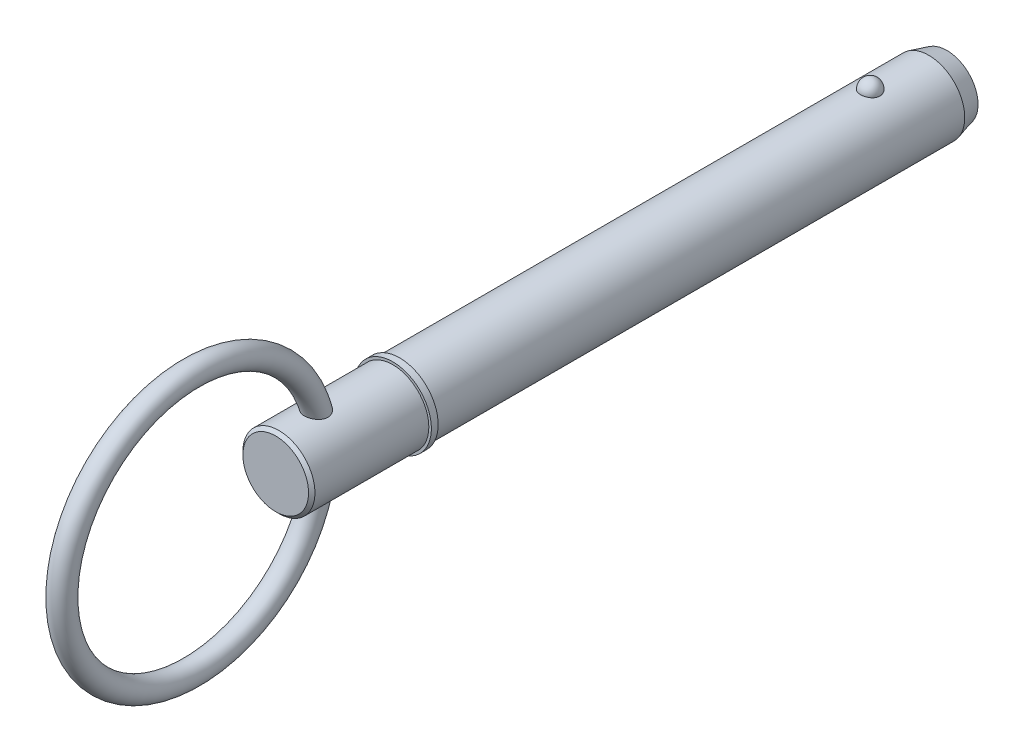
ISO-10303-21;
HEADER;
FILE_DESCRIPTION(('STEP AP214'),'2;1');
FILE_NAME('part.step','',(''),(''),'','','');
FILE_SCHEMA(('AUTOMOTIVE_DESIGN { 1 0 10303 214 1 1 1 1 }'));
ENDSEC;
DATA;
#1=APPLICATION_CONTEXT('core data for automotive mechanical design processes');
#2=APPLICATION_PROTOCOL_DEFINITION('international standard','automotive_design',2000,#1);
#3=PRODUCT_CONTEXT('',#1,'mechanical');
#4=PRODUCT('Part','Part','',(#3));
#5=PRODUCT_RELATED_PRODUCT_CATEGORY('part','',(#4));
#6=PRODUCT_DEFINITION_FORMATION('','',#4);
#7=PRODUCT_DEFINITION_CONTEXT('part definition',#1,'design');
#8=PRODUCT_DEFINITION('design','',#6,#7);
#9=PRODUCT_DEFINITION_SHAPE('','',#8);
#10=(LENGTH_UNIT() NAMED_UNIT(*) SI_UNIT(.MILLI.,.METRE.));
#11=(NAMED_UNIT(*) PLANE_ANGLE_UNIT() SI_UNIT($,.RADIAN.));
#12=(NAMED_UNIT(*) SI_UNIT($,.STERADIAN.) SOLID_ANGLE_UNIT());
#13=UNCERTAINTY_MEASURE_WITH_UNIT(LENGTH_MEASURE(1.E-05),#10,'distance_accuracy_value','');
#14=(GEOMETRIC_REPRESENTATION_CONTEXT(3) GLOBAL_UNCERTAINTY_ASSIGNED_CONTEXT((#13)) GLOBAL_UNIT_ASSIGNED_CONTEXT((#10,
#11,#12)) REPRESENTATION_CONTEXT('',''));
#15=CARTESIAN_POINT('',(0.,0.,0.));
#16=DIRECTION('',(0.,0.,1.));
#17=DIRECTION('',(1.,0.,0.));
#18=AXIS2_PLACEMENT_3D('',#15,#16,#17);
#19=CARTESIAN_POINT('',(0.,0.,101.6));
#20=DIRECTION('',(0.,0.,-1.));
#21=DIRECTION('',(-1.,0.,0.));
#22=AXIS2_PLACEMENT_3D('',#19,#20,#21);
#23=CYLINDRICAL_SURFACE('',#22,7.94);
#24=CARTESIAN_POINT('',(2.13020349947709,7.64891057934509,-2.15));
#25=CARTESIAN_POINT('',(2.1302012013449,7.64891247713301,-2.02978166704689));
#26=CARTESIAN_POINT('',(2.12037546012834,7.65166842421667,-1.90953383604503));
#27=CARTESIAN_POINT('',(2.08130792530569,7.66238579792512,-1.67243962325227));
#28=CARTESIAN_POINT('',(2.05205785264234,7.67034944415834,-1.55559471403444));
#29=CARTESIAN_POINT('',(1.97489181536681,7.69057749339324,-1.32869361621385));
#30=CARTESIAN_POINT('',(1.92698409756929,7.70283999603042,-1.21863445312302));
#31=CARTESIAN_POINT('',(1.81370645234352,7.73029430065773,-1.00831338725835));
#32=CARTESIAN_POINT('',(1.74833715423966,7.7454859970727,-0.908051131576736));
#33=CARTESIAN_POINT('',(1.60144242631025,7.77718699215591,-0.719628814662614));
#34=CARTESIAN_POINT('',(1.51984382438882,7.7937020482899,-0.631526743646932));
#35=CARTESIAN_POINT('',(1.34279837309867,7.82614685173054,-0.470411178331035));
#36=CARTESIAN_POINT('',(1.24735148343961,7.84207659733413,-0.397397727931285));
#37=CARTESIAN_POINT('',(1.04544839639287,7.87153116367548,-0.26868118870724));
#38=CARTESIAN_POINT('',(0.939022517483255,7.88506234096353,-0.212932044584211));
#39=CARTESIAN_POINT('',(0.717931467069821,7.90825597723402,-0.120080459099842));
#40=CARTESIAN_POINT('',(0.603267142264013,7.9179188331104,-0.0829761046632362));
#41=CARTESIAN_POINT('',(0.371015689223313,7.93216561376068,-0.0289596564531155));
#42=CARTESIAN_POINT('',(0.253510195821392,7.93683225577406,-0.0117183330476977));
#43=CARTESIAN_POINT('',(0.0171784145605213,7.94086051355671,0.0031892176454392));
#44=CARTESIAN_POINT('',(-0.101647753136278,7.94022260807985,0.00085721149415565));
#45=CARTESIAN_POINT('',(-0.335567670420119,7.93375751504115,-0.023146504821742));
#46=CARTESIAN_POINT('',(-0.450690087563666,7.92799987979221,-0.0445590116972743));
#47=CARTESIAN_POINT('',(-0.675610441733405,7.91200792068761,-0.105760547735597));
#48=CARTESIAN_POINT('',(-0.785408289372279,7.90177352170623,-0.145549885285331));
#49=CARTESIAN_POINT('',(-0.9972706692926,7.87784802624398,-0.242675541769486));
#50=CARTESIAN_POINT('',(-1.0992893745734,7.86413823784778,-0.300107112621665));
#51=CARTESIAN_POINT('',(-1.29223659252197,7.83474718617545,-0.430887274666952));
#52=CARTESIAN_POINT('',(-1.38316404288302,7.81906573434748,-0.504237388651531));
#53=CARTESIAN_POINT('',(-1.55313516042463,7.78710451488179,-0.666358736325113));
#54=CARTESIAN_POINT('',(-1.63193689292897,7.77081906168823,-0.75538257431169));
#55=CARTESIAN_POINT('',(-1.77366356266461,7.73970270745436,-0.945507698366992));
#56=CARTESIAN_POINT('',(-1.83658745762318,7.72487190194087,-1.04660977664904));
#57=CARTESIAN_POINT('',(-1.94556640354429,7.6981535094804,-1.25927689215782));
#58=CARTESIAN_POINT('',(-1.99143480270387,7.6862989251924,-1.3709418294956));
#59=CARTESIAN_POINT('',(-2.06418311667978,7.66708387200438,-1.60066153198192));
#60=CARTESIAN_POINT('',(-2.0910635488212,7.65972328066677,-1.71871612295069));
#61=CARTESIAN_POINT('',(-2.12508507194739,7.65035479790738,-1.9573607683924));
#62=CARTESIAN_POINT('',(-2.13230490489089,7.64832555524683,-2.0779387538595));
#63=CARTESIAN_POINT('',(-2.12704767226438,7.64978921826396,-2.31862835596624));
#64=CARTESIAN_POINT('',(-2.1145710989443,7.6532819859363,-2.43873998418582));
#65=CARTESIAN_POINT('',(-2.07034166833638,7.66536368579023,-2.67451689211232));
#66=CARTESIAN_POINT('',(-2.03867758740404,7.67392914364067,-2.79020005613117));
#67=CARTESIAN_POINT('',(-1.95694065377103,7.69517736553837,-3.01446692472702));
#68=CARTESIAN_POINT('',(-1.90686710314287,7.70786028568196,-3.12305035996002));
#69=CARTESIAN_POINT('',(-1.78925555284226,7.73600831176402,-3.3306597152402));
#70=CARTESIAN_POINT('',(-1.72162904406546,7.75148739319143,-3.4296336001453));
#71=CARTESIAN_POINT('',(-1.57074739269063,7.78346215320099,-3.61466914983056));
#72=CARTESIAN_POINT('',(-1.48749169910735,7.79995786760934,-3.70073035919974));
#73=CARTESIAN_POINT('',(-1.30720250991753,7.83219119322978,-3.85783594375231));
#74=CARTESIAN_POINT('',(-1.2101234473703,7.84792605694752,-3.92882863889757));
#75=CARTESIAN_POINT('',(-1.00503150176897,7.87681523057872,-4.05342383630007));
#76=CARTESIAN_POINT('',(-0.897019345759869,7.88996971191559,-4.10702749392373));
#77=CARTESIAN_POINT('',(-0.674439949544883,7.91208451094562,-4.19477736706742));
#78=CARTESIAN_POINT('',(-0.55996501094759,7.92109245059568,-4.22914554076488));
#79=CARTESIAN_POINT('',(-0.326625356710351,7.93413878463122,-4.27838865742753));
#80=CARTESIAN_POINT('',(-0.20776113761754,7.93817773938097,-4.29326579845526));
#81=CARTESIAN_POINT('',(0.0287357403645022,7.94081322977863,-4.3030062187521));
#82=CARTESIAN_POINT('',(0.14635312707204,7.93950453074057,-4.29821797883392));
#83=CARTESIAN_POINT('',(0.379062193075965,7.93180098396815,-4.26955229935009));
#84=CARTESIAN_POINT('',(0.494153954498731,7.92540630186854,-4.24567548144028));
#85=CARTESIAN_POINT('',(0.718185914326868,7.90824874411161,-4.17962260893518));
#86=CARTESIAN_POINT('',(0.827145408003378,7.89750055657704,-4.13750805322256));
#87=CARTESIAN_POINT('',(1.03638036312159,7.87277755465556,-4.03615078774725));
#88=CARTESIAN_POINT('',(1.13665531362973,7.85880255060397,-3.97690707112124));
#89=CARTESIAN_POINT('',(1.32729731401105,7.82887859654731,-3.84189297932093));
#90=CARTESIAN_POINT('',(1.41749828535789,7.81290379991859,-3.76589388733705));
#91=CARTESIAN_POINT('',(1.58397257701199,7.78086330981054,-3.59992466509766));
#92=CARTESIAN_POINT('',(1.66024342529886,7.76479760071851,-3.50995206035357));
#93=CARTESIAN_POINT('',(1.79805631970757,7.73405928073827,-3.31688321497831));
#94=CARTESIAN_POINT('',(1.85933944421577,7.719413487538,-3.213597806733));
#95=CARTESIAN_POINT('',(1.96397499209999,7.69345992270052,-2.99796163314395));
#96=CARTESIAN_POINT('',(2.00733488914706,7.68215076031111,-2.88561466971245));
#97=CARTESIAN_POINT('',(2.07068045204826,7.66529896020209,-2.6699413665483));
#98=CARTESIAN_POINT('',(2.09296296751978,7.65919990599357,-2.56732606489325));
#99=CARTESIAN_POINT('',(2.12272535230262,7.65100492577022,-2.35981463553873));
#100=CARTESIAN_POINT('',(2.13020550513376,7.64890892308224,-2.25491855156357));
#101=CARTESIAN_POINT('',(2.13020349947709,7.64891057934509,-2.15));
#102=B_SPLINE_CURVE_WITH_KNOTS('',3,(#24,#25,#26,#27,#28,#29,#30,#31,#32,#33,#34,#35,#36,#37,
#38,#39,#40,#41,#42,#43,#44,#45,#46,#47,#48,#49,#50,#51,#52,#53,#54,#55,#56,#57,#58,#59,#60,#61,
#62,#63,#64,#65,#66,#67,#68,#69,#70,#71,#72,#73,#74,#75,#76,#77,#78,#79,#80,#81,#82,#83,#84,#85,
#86,#87,#88,#89,#90,#91,#92,#93,#94,#95,#96,#97,#98,#99,#100,#101),.UNSPECIFIED.,.T.,.F.,(4,2,2,
2,2,2,2,2,2,2,2,2,2,2,2,2,2,2,2,2,2,2,2,2,2,2,2,2,2,2,2,2,2,2,2,2,2,2,4),(0.,0.360277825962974,
0.720709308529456,1.0809816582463,1.44124102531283,1.80316307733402,2.16508618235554,
2.52603531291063,2.88694740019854,3.24178717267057,3.59659491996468,3.94665496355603,
4.29672088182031,4.64871108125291,5.0007349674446,5.3590619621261,5.71741247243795,
6.079576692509,6.44173104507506,6.80243279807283,7.16312553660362,7.52216203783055,
7.88121215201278,8.24210915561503,8.60301888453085,8.96514709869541,9.32725124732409,
9.68508606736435,10.0428805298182,10.3943622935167,10.7458326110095,11.0961268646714,
11.4464417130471,11.8018724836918,12.1573662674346,12.5186252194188,12.8797333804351,
13.1941658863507,13.5085923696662),.UNSPECIFIED.);
#103=CARTESIAN_POINT('',(2.13020349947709,7.64891057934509,-2.15));
#104=VERTEX_POINT('',#103);
#105=EDGE_CURVE('E102',#104,#104,#102,.T.);
#106=ORIENTED_EDGE('',*,*,#105,.T.);
#107=EDGE_LOOP('',(#106));
#108=FACE_BOUND('',#107,.T.);
#109=CARTESIAN_POINT('',(0.,0.,-15.05));
#110=DIRECTION('',(0.,0.,-1.));
#111=DIRECTION('',(-1.,0.,0.));
#112=AXIS2_PLACEMENT_3D('',#109,#110,#111);
#113=CIRCLE('',#112,7.94);
#114=CARTESIAN_POINT('',(-7.94,0.,-15.05));
#115=VERTEX_POINT('',#114);
#116=EDGE_CURVE('E110',#115,#115,#113,.F.);
#117=ORIENTED_EDGE('',*,*,#116,.T.);
#118=EDGE_LOOP('',(#117));
#119=FACE_BOUND('',#118,.T.);
#120=CARTESIAN_POINT('',(0.,0.,101.6));
#121=DIRECTION('',(0.,0.,1.));
#122=DIRECTION('',(1.,0.,0.));
#123=AXIS2_PLACEMENT_3D('',#120,#121,#122);
#124=CIRCLE('',#123,7.94);
#125=CARTESIAN_POINT('',(7.94,0.,101.6));
#126=VERTEX_POINT('',#125);
#127=EDGE_CURVE('E108',#126,#126,#124,.T.);
#128=ORIENTED_EDGE('',*,*,#127,.F.);
#129=EDGE_LOOP('',(#128));
#130=FACE_BOUND('',#129,.T.);
#131=ADVANCED_FACE('F39',(#108,#119,#130),#23,.T.);
#132=CARTESIAN_POINT('',(0.,0.,-19.05));
#133=DIRECTION('',(0.,0.,-1.));
#134=DIRECTION('',(-1.,0.,0.));
#135=AXIS2_PLACEMENT_3D('',#132,#133,#134);
#136=PLANE('',#135);
#137=CARTESIAN_POINT('',(0.,0.,-19.05));
#138=DIRECTION('',(0.,0.,-1.));
#139=DIRECTION('',(-1.,0.,0.));
#140=AXIS2_PLACEMENT_3D('',#137,#138,#139);
#141=CIRCLE('',#140,6.8682032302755);
#142=CARTESIAN_POINT('',(-6.8682032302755,0.,-19.05));
#143=VERTEX_POINT('',#142);
#144=EDGE_CURVE('E144',#143,#143,#141,.T.);
#145=ORIENTED_EDGE('',*,*,#144,.T.);
#146=EDGE_LOOP('',(#145));
#147=FACE_BOUND('',#146,.T.);
#148=ADVANCED_FACE('F88',(#147),#136,.T.);
#149=CARTESIAN_POINT('',(0.,0.,-19.05));
#150=DIRECTION('',(0.,0.,1.));
#151=DIRECTION('',(1.,0.,0.));
#152=AXIS2_PLACEMENT_3D('',#149,#150,#151);
#153=CONICAL_SURFACE('',#152,6.8682032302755,0.261799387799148);
#154=ORIENTED_EDGE('',*,*,#116,.F.);
#155=EDGE_LOOP('',(#154));
#156=FACE_BOUND('',#155,.T.);
#157=ORIENTED_EDGE('',*,*,#144,.F.);
#158=EDGE_LOOP('',(#157));
#159=FACE_BOUND('',#158,.T.);
#160=ADVANCED_FACE('F94',(#156,#159),#153,.T.);
#161=CARTESIAN_POINT('',(0.,7.94,-2.15));
#162=DIRECTION('',(0.,1.,0.));
#163=DIRECTION('',(0.,0.,-1.));
#164=AXIS2_PLACEMENT_3D('',#161,#162,#163);
#165=SPHERICAL_SURFACE('',#164,2.15);
#166=ORIENTED_EDGE('',*,*,#105,.F.);
#167=EDGE_LOOP('',(#166));
#168=FACE_BOUND('',#167,.T.);
#169=ADVANCED_FACE('F113',(#168),#165,.T.);
#170=CARTESIAN_POINT('',(0.,0.,101.6));
#171=DIRECTION('',(0.,0.,-1.));
#172=DIRECTION('',(-1.,0.,0.));
#173=AXIS2_PLACEMENT_3D('',#170,#171,#172);
#174=PLANE('',#173);
#175=ORIENTED_EDGE('',*,*,#127,.T.);
#176=EDGE_LOOP('',(#175));
#177=FACE_BOUND('',#176,.T.);
#178=CARTESIAN_POINT('',(0.,0.,101.6));
#179=DIRECTION('',(0.,0.,-1.));
#180=DIRECTION('',(-1.,0.,0.));
#181=AXIS2_PLACEMENT_3D('',#178,#179,#180);
#182=CIRCLE('',#181,8.5);
#183=CARTESIAN_POINT('',(-8.5,0.,101.6));
#184=VERTEX_POINT('',#183);
#185=EDGE_CURVE('E109',#184,#184,#182,.T.);
#186=ORIENTED_EDGE('',*,*,#185,.T.);
#187=EDGE_LOOP('',(#186));
#188=FACE_BOUND('',#187,.T.);
#189=ADVANCED_FACE('F117',(#177,#188),#174,.T.);
#190=CARTESIAN_POINT('',(0.,0.,33.7287874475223));
#191=DIRECTION('',(0.,0.,-1.));
#192=DIRECTION('',(-1.,0.,0.));
#193=AXIS2_PLACEMENT_3D('',#190,#191,#192);
#194=CYLINDRICAL_SURFACE('',#193,8.5);
#195=CARTESIAN_POINT('',(0.,0.,103.1));
#196=DIRECTION('',(0.,0.,-1.));
#197=DIRECTION('',(-1.,0.,0.));
#198=AXIS2_PLACEMENT_3D('',#195,#196,#197);
#199=CIRCLE('',#198,8.5);
#200=CARTESIAN_POINT('',(-8.5,0.,103.1));
#201=VERTEX_POINT('',#200);
#202=EDGE_CURVE('E134',#201,#201,#199,.T.);
#203=ORIENTED_EDGE('',*,*,#202,.T.);
#204=EDGE_LOOP('',(#203));
#205=FACE_BOUND('',#204,.T.);
#206=ORIENTED_EDGE('',*,*,#185,.F.);
#207=EDGE_LOOP('',(#206));
#208=FACE_BOUND('',#207,.T.);
#209=ADVANCED_FACE('F121',(#205,#208),#194,.T.);
#210=CARTESIAN_POINT('',(0.,8.5,103.1));
#211=DIRECTION('',(0.,0.,1.));
#212=DIRECTION('',(1.,0.,0.));
#213=AXIS2_PLACEMENT_3D('',#210,#211,#212);
#214=PLANE('',#213);
#215=CARTESIAN_POINT('',(0.,0.,103.1));
#216=DIRECTION('',(0.,0.,1.));
#217=DIRECTION('',(1.,0.,0.));
#218=AXIS2_PLACEMENT_3D('',#215,#216,#217);
#219=CIRCLE('',#218,7.94);
#220=CARTESIAN_POINT('',(7.94,0.,103.1));
#221=VERTEX_POINT('',#220);
#222=EDGE_CURVE('E112',#221,#221,#219,.T.);
#223=ORIENTED_EDGE('',*,*,#222,.F.);
#224=EDGE_LOOP('',(#223));
#225=FACE_BOUND('',#224,.T.);
#226=ORIENTED_EDGE('',*,*,#202,.F.);
#227=EDGE_LOOP('',(#226));
#228=FACE_BOUND('',#227,.T.);
#229=ADVANCED_FACE('F85',(#225,#228),#214,.T.);
#230=CARTESIAN_POINT('',(0.,0.,128.91));
#231=DIRECTION('',(0.,0.,-1.));
#232=DIRECTION('',(-1.,0.,0.));
#233=AXIS2_PLACEMENT_3D('',#230,#231,#232);
#234=CYLINDRICAL_SURFACE('',#233,7.94);
#235=CARTESIAN_POINT('',(-1.15544091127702,-7.85547938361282,117.711910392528));
#236=CARTESIAN_POINT('',(-1.03089695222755,-7.87379554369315,117.649615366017));
#237=CARTESIAN_POINT('',(-0.900845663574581,-7.8898743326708,117.597593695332));
#238=CARTESIAN_POINT('',(-0.633417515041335,-7.91583465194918,117.515265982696));
#239=CARTESIAN_POINT('',(-0.496037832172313,-7.92571377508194,117.484968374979));
#240=CARTESIAN_POINT('',(-0.217881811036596,-7.93823020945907,117.446773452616));
#241=CARTESIAN_POINT('',(-0.0771057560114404,-7.94086812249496,117.438874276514));
#242=CARTESIAN_POINT('',(0.20382834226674,-7.93862624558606,117.445648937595));
#243=CARTESIAN_POINT('',(0.343986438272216,-7.93374711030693,117.460320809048));
#244=CARTESIAN_POINT('',(0.61954486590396,-7.9169944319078,117.511877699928));
#245=CARTESIAN_POINT('',(0.754950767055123,-7.9051293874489,117.548735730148));
#246=CARTESIAN_POINT('',(1.01737529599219,-7.8756583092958,117.643842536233));
#247=CARTESIAN_POINT('',(1.14439334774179,-7.85805188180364,117.702092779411));
#248=CARTESIAN_POINT('',(1.38668443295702,-7.81893907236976,117.838842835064));
#249=CARTESIAN_POINT('',(1.50193494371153,-7.79742542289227,117.917380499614));
#250=CARTESIAN_POINT('',(1.71711272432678,-7.75288428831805,118.092872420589));
#251=CARTESIAN_POINT('',(1.81704089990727,-7.72985689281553,118.189825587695));
#252=CARTESIAN_POINT('',(1.99787261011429,-7.68509802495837,118.39887149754));
#253=CARTESIAN_POINT('',(2.07893183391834,-7.66335713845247,118.510827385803));
#254=CARTESIAN_POINT('',(2.2207658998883,-7.6234672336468,118.747480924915));
#255=CARTESIAN_POINT('',(2.28154607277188,-7.6053172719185,118.872175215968));
#256=CARTESIAN_POINT('',(2.38011540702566,-7.57504217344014,119.127618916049));
#257=CARTESIAN_POINT('',(2.41840843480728,-7.56278621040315,119.258158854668));
#258=CARTESIAN_POINT('',(2.47363993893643,-7.54490265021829,119.524095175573));
#259=CARTESIAN_POINT('',(2.49057788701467,-7.53927521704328,119.659491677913));
#260=CARTESIAN_POINT('',(2.50351014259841,-7.53499042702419,119.93242871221));
#261=CARTESIAN_POINT('',(2.49933630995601,-7.53638902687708,120.069977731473));
#262=CARTESIAN_POINT('',(2.47072547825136,-7.54581524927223,120.342698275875));
#263=CARTESIAN_POINT('',(2.44628184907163,-7.55384504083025,120.477869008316));
#264=CARTESIAN_POINT('',(2.3758931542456,-7.57629160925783,120.753085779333));
#265=CARTESIAN_POINT('',(2.32844094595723,-7.5911515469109,120.89270896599));
#266=CARTESIAN_POINT('',(2.21332780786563,-7.62550828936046,121.162781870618));
#267=CARTESIAN_POINT('',(2.14565489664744,-7.64500784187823,121.293226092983));
#268=CARTESIAN_POINT('',(1.98438755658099,-7.68852412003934,121.553702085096));
#269=CARTESIAN_POINT('',(1.88896913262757,-7.71279219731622,121.682569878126));
#270=CARTESIAN_POINT('',(1.67743245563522,-7.76154719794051,121.922112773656));
#271=CARTESIAN_POINT('',(1.56130644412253,-7.78603420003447,122.032781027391));
#272=CARTESIAN_POINT('',(1.31168281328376,-7.83191501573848,122.230100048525));
#273=CARTESIAN_POINT('',(1.17841631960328,-7.85334315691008,122.317029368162));
#274=CARTESIAN_POINT('',(0.967442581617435,-7.88116219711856,122.426657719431));
#275=CARTESIAN_POINT('',(0.895283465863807,-7.88971376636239,122.459736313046));
#276=CARTESIAN_POINT('',(0.747777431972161,-7.90505596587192,122.518400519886));
#277=CARTESIAN_POINT('',(0.672431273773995,-7.91184701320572,122.543987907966));
#278=CARTESIAN_POINT('',(0.53057561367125,-7.92252382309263,122.583912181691));
#279=CARTESIAN_POINT('',(0.464394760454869,-7.92668987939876,122.599349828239));
#280=CARTESIAN_POINT('',(0.330815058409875,-7.9333870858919,122.624069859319));
#281=CARTESIAN_POINT('',(0.263416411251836,-7.93591850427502,122.63335325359));
#282=CARTESIAN_POINT('',(0.128041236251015,-7.93925585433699,122.645577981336));
#283=CARTESIAN_POINT('',(0.0600650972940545,-7.94006286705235,122.648523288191));
#284=CARTESIAN_POINT('',(-0.0758408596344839,-7.93992929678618,122.648033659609));
#285=CARTESIAN_POINT('',(-0.143770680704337,-7.93898884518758,122.644599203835));
#286=CARTESIAN_POINT('',(-0.330023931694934,-7.93402174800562,122.626406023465));
#287=CARTESIAN_POINT('',(-0.447720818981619,-7.92820264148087,122.605060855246));
#288=CARTESIAN_POINT('',(-0.677833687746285,-7.91185818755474,122.544093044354));
#289=CARTESIAN_POINT('',(-0.790248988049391,-7.90133223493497,122.504468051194));
#290=CARTESIAN_POINT('',(-1.01082100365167,-7.8762011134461,122.407436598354));
#291=CARTESIAN_POINT('',(-1.11873674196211,-7.86147932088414,122.349515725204));
#292=CARTESIAN_POINT('',(-1.32464461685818,-7.8294189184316,122.218755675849));
#293=CARTESIAN_POINT('',(-1.42263264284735,-7.81207923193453,122.145910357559));
#294=CARTESIAN_POINT('',(-1.62038324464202,-7.77363945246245,121.976536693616));
#295=CARTESIAN_POINT('',(-1.7184938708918,-7.75235190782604,121.878123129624));
#296=CARTESIAN_POINT('',(-1.89908721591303,-7.71010284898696,121.667783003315));
#297=CARTESIAN_POINT('',(-1.9815587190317,-7.68914157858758,121.555846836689));
#298=CARTESIAN_POINT('',(-2.1397427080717,-7.64674394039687,121.305108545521));
#299=CARTESIAN_POINT('',(-2.21304020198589,-7.62562536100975,121.164719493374));
#300=CARTESIAN_POINT('',(-2.33615659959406,-7.5888154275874,120.873266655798));
#301=CARTESIAN_POINT('',(-2.38596943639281,-7.57312547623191,120.722200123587));
#302=CARTESIAN_POINT('',(-2.46059473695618,-7.54921618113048,120.410492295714));
#303=CARTESIAN_POINT('',(-2.48494918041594,-7.54113395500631,120.249728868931));
#304=CARTESIAN_POINT('',(-2.50480773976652,-7.53456588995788,119.926244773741));
#305=CARTESIAN_POINT('',(-2.50033692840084,-7.53607171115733,119.763525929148));
#306=CARTESIAN_POINT('',(-2.46306926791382,-7.54832452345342,119.457165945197));
#307=CARTESIAN_POINT('',(-2.4329569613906,-7.55819528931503,119.313162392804));
#308=CARTESIAN_POINT('',(-2.34806892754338,-7.58499431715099,119.033304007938));
#309=CARTESIAN_POINT('',(-2.29330013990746,-7.60192059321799,118.897446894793));
#310=CARTESIAN_POINT('',(-2.16523724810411,-7.63933506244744,118.64765733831));
#311=CARTESIAN_POINT('',(-2.09353456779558,-7.65948502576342,118.532853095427));
#312=CARTESIAN_POINT('',(-1.93200913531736,-7.7018104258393,118.317268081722));
#313=CARTESIAN_POINT('',(-1.84219262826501,-7.72398516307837,118.216482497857));
#314=CARTESIAN_POINT('',(-1.65746337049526,-7.76558957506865,118.04131484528));
#315=CARTESIAN_POINT('',(-1.56413624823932,-7.78505810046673,117.965259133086));
#316=CARTESIAN_POINT('',(-1.36706423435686,-7.82207051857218,117.82753576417));
#317=CARTESIAN_POINT('',(-1.26331856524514,-7.83961426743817,117.765869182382));
#318=CARTESIAN_POINT('',(-1.15544091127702,-7.85547938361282,117.711910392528));
#319=B_SPLINE_CURVE_WITH_KNOTS('',3,(#235,#236,#237,#238,#239,#240,#241,#242,#243,#244,#245,
#246,#247,#248,#249,#250,#251,#252,#253,#254,#255,#256,#257,#258,#259,#260,#261,#262,#263,#264,
#265,#266,#267,#268,#269,#270,#271,#272,#273,#274,#275,#276,#277,#278,#279,#280,#281,#282,#283,
#284,#285,#286,#287,#288,#289,#290,#291,#292,#293,#294,#295,#296,#297,#298,#299,#300,#301,#302,
#303,#304,#305,#306,#307,#308,#309,#310,#311,#312,#313,#314,#315,#316,#317,#318),.UNSPECIFIED.,
.T.,.F.,(4,2,2,2,2,2,2,2,2,2,2,2,2,2,2,2,2,2,2,2,2,2,2,2,2,2,2,2,2,2,2,2,2,2,2,2,2,2,2,2,2,4),
(0.,0.420927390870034,0.842018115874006,1.26307384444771,1.68409290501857,2.10460083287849,
2.52513760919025,2.94646475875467,3.36776699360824,3.78545897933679,4.20304108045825,
4.61086922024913,5.01870744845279,5.42979890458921,5.84102487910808,6.2838331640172,
6.72690434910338,7.21113455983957,7.69554657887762,8.17400305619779,8.41316278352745,
8.65226580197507,8.85622998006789,9.0601606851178,9.26396350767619,9.46775100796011,
9.82521046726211,10.1827159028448,10.5513335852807,10.9201032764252,11.3402098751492,
11.7606166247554,12.2377707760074,12.715048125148,13.2007716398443,13.6860727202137,
14.1260485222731,14.5659005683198,14.9745225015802,15.3830037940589,15.7475760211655,
16.1121754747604),.UNSPECIFIED.);
#320=CARTESIAN_POINT('',(-1.15544091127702,-7.85547938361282,117.711910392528));
#321=VERTEX_POINT('',#320);
#322=EDGE_CURVE('E10',#321,#321,#319,.T.);
#323=ORIENTED_EDGE('',*,*,#322,.F.);
#324=EDGE_LOOP('',(#323));
#325=FACE_BOUND('',#324,.T.);
#326=CARTESIAN_POINT('',(-1.15544091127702,7.85547938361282,117.711910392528));
#327=CARTESIAN_POINT('',(-1.278579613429,7.83736699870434,117.773507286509));
#328=CARTESIAN_POINT('',(-1.39638360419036,7.8170599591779,117.845172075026));
#329=CARTESIAN_POINT('',(-1.61803025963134,7.77421032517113,118.00708252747));
#330=CARTESIAN_POINT('',(-1.72186951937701,7.7516671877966,118.097332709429));
#331=CARTESIAN_POINT('',(-1.91269683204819,7.70680387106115,118.294395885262));
#332=CARTESIAN_POINT('',(-1.99967065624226,7.68448389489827,118.401222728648));
#333=CARTESIAN_POINT('',(-2.15412555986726,7.64262858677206,118.628607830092));
#334=CARTESIAN_POINT('',(-2.2216118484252,7.62309251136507,118.749162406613));
#335=CARTESIAN_POINT('',(-2.3342927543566,7.5893410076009,118.998377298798));
#336=CARTESIAN_POINT('',(-2.3798562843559,7.57503857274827,119.126859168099));
#337=CARTESIAN_POINT('',(-2.44955571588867,7.55278941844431,119.390011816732));
#338=CARTESIAN_POINT('',(-2.47369226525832,7.544842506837,119.52468240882));
#339=CARTESIAN_POINT('',(-2.50059611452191,7.53596831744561,119.796137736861));
#340=CARTESIAN_POINT('',(-2.50339277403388,7.53503139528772,119.932919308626));
#341=CARTESIAN_POINT('',(-2.48855779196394,7.53994222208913,120.205224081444));
#342=CARTESIAN_POINT('',(-2.47092012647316,7.54579197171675,120.34074689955));
#343=CARTESIAN_POINT('',(-2.41469361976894,7.56397908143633,120.616293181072));
#344=CARTESIAN_POINT('',(-2.37479606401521,7.57671999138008,120.75602135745));
#345=CARTESIAN_POINT('',(-2.27489955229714,7.60730881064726,121.027515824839));
#346=CARTESIAN_POINT('',(-2.2148900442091,7.6251594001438,121.159277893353));
#347=CARTESIAN_POINT('',(-2.06943931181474,7.66598084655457,121.42452508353));
#348=CARTESIAN_POINT('',(-1.98208275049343,7.68928197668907,121.556914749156));
#349=CARTESIAN_POINT('',(-1.78658869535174,7.73704343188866,121.805235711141));
#350=CARTESIAN_POINT('',(-1.67843905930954,7.76150442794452,121.921157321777));
#351=CARTESIAN_POINT('',(-1.44142605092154,7.80900750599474,122.133699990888));
#352=CARTESIAN_POINT('',(-1.31231821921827,7.83202775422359,122.230058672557));
#353=CARTESIAN_POINT('',(-1.10627655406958,7.86286215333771,122.354614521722));
#354=CARTESIAN_POINT('',(-1.035525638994,7.87252500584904,122.392805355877));
#355=CARTESIAN_POINT('',(-0.890375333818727,7.89025728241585,122.461885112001));
#356=CARTESIAN_POINT('',(-0.815978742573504,7.89832790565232,122.492779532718));
#357=CARTESIAN_POINT('',(-0.674180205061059,7.91160332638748,122.543082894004));
#358=CARTESIAN_POINT('',(-0.607145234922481,7.91704543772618,122.563468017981));
#359=CARTESIAN_POINT('',(-0.471385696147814,7.92628663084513,122.597876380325));
#360=CARTESIAN_POINT('',(-0.402662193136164,7.93008672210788,122.611903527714));
#361=CARTESIAN_POINT('',(-0.264153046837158,7.9359070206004,122.633322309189));
#362=CARTESIAN_POINT('',(-0.194368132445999,7.9379283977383,122.640718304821));
#363=CARTESIAN_POINT('',(-0.0544054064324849,7.940122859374,122.648743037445));
#364=CARTESIAN_POINT('',(0.0157723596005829,7.94029615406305,122.649372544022));
#365=CARTESIAN_POINT('',(0.206295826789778,7.93822912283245,122.641825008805));
#366=CARTESIAN_POINT('',(0.326425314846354,7.93416340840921,122.626989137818));
#367=CARTESIAN_POINT('',(0.562310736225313,7.92094769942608,122.578077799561));
#368=CARTESIAN_POINT('',(0.678066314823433,7.91179729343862,122.54400077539));
#369=CARTESIAN_POINT('',(0.903029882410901,7.88929555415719,122.458269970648));
#370=CARTESIAN_POINT('',(1.01220356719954,7.87592415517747,122.406532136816));
#371=CARTESIAN_POINT('',(1.22142047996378,7.84620431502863,122.287793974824));
#372=CARTESIAN_POINT('',(1.32146048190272,7.82985482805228,122.220788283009));
#373=CARTESIAN_POINT('',(1.52328754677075,7.7932678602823,122.064309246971));
#374=CARTESIAN_POINT('',(1.62365085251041,7.77280069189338,121.973056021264));
#375=CARTESIAN_POINT('',(1.80985117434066,7.73156849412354,121.776815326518));
#376=CARTESIAN_POINT('',(1.89567824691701,7.71080327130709,121.67181854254));
#377=CARTESIAN_POINT('',(2.06302404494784,7.66785771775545,121.434543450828));
#378=CARTESIAN_POINT('',(2.14213178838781,7.64590590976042,121.300514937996));
#379=CARTESIAN_POINT('',(2.27825755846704,7.60645646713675,121.020994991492));
#380=CARTESIAN_POINT('',(2.33526577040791,7.58896081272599,120.875498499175));
#381=CARTESIAN_POINT('',(2.42707573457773,7.56011538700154,120.570242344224));
#382=CARTESIAN_POINT('',(2.4608459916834,7.54905411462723,120.410140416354));
#383=CARTESIAN_POINT('',(2.49980168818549,7.53624914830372,120.086129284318));
#384=CARTESIAN_POINT('',(2.50500938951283,7.5344981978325,119.922223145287));
#385=CARTESIAN_POINT('',(2.48594104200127,7.54080673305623,119.609976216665));
#386=CARTESIAN_POINT('',(2.46407777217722,7.54806351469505,119.461473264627));
#387=CARTESIAN_POINT('',(2.3945479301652,7.57040718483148,119.171258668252));
#388=CARTESIAN_POINT('',(2.34689355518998,7.58549037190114,119.029543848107));
#389=CARTESIAN_POINT('',(2.2318274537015,7.62009243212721,118.769141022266));
#390=CARTESIAN_POINT('',(2.16637710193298,7.63914093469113,118.649517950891));
#391=CARTESIAN_POINT('',(2.01638736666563,7.68009146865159,118.42346099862));
#392=CARTESIAN_POINT('',(1.93184850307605,7.7019934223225,118.317026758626));
#393=CARTESIAN_POINT('',(1.74664202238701,7.74608439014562,118.12066977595));
#394=CARTESIAN_POINT('',(1.64607913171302,7.76827073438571,118.03064744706));
#395=CARTESIAN_POINT('',(1.43119791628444,7.81071401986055,117.868308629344));
#396=CARTESIAN_POINT('',(1.31687846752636,7.83097080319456,117.795993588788));
#397=CARTESIAN_POINT('',(1.07477437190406,7.86789551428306,117.669149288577));
#398=CARTESIAN_POINT('',(0.94673952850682,7.88446964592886,117.615069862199));
#399=CARTESIAN_POINT('',(0.683029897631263,7.91167708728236,117.528213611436));
#400=CARTESIAN_POINT('',(0.547354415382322,7.92230985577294,117.495438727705));
#401=CARTESIAN_POINT('',(0.271066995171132,7.93658630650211,117.451730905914));
#402=CARTESIAN_POINT('',(0.130424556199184,7.94017418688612,117.440972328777));
#403=CARTESIAN_POINT('',(-0.150736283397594,7.93981282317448,117.442062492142));
#404=CARTESIAN_POINT('',(-0.291254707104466,7.93586558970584,117.453905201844));
#405=CARTESIAN_POINT('',(-0.556023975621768,7.92151946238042,117.497891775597));
#406=CARTESIAN_POINT('',(-0.68062174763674,7.91171585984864,117.528166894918));
#407=CARTESIAN_POINT('',(-0.923476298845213,7.88705844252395,117.606736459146));
#408=CARTESIAN_POINT('',(-1.04173303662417,7.87220459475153,117.655031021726));
#409=CARTESIAN_POINT('',(-1.15544091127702,7.85547938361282,117.711910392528));
#410=B_SPLINE_CURVE_WITH_KNOTS('',3,(#326,#327,#328,#329,#330,#331,#332,#333,#334,#335,#336,
#337,#338,#339,#340,#341,#342,#343,#344,#345,#346,#347,#348,#349,#350,#351,#352,#353,#354,#355,
#356,#357,#358,#359,#360,#361,#362,#363,#364,#365,#366,#367,#368,#369,#370,#371,#372,#373,#374,
#375,#376,#377,#378,#379,#380,#381,#382,#383,#384,#385,#386,#387,#388,#389,#390,#391,#392,#393,
#394,#395,#396,#397,#398,#399,#400,#401,#402,#403,#404,#405,#406,#407,#408,#409),.UNSPECIFIED.,
.T.,.F.,(4,2,2,2,2,2,2,2,2,2,2,2,2,2,2,2,2,2,2,2,2,2,2,2,2,2,2,2,2,2,2,2,2,2,2,2,2,2,2,2,2,4),
(0.,0.416167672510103,0.832436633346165,1.24905527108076,1.66556244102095,2.07479168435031,
2.48400855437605,2.89266231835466,3.30143658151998,3.73725068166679,4.17329379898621,
4.65204873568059,5.13108409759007,5.61617224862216,5.85876072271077,6.10116578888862,
6.31168904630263,6.52208269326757,6.7323378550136,6.94256910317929,7.30398888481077,
7.66543791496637,8.02863174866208,8.39195337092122,8.80190673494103,9.21213940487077,
9.68159903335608,10.1512669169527,10.6406305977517,11.1296128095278,11.5779838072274,
12.0261429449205,12.4372146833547,12.8482752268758,13.256751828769,13.6652618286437,
14.0832160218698,14.5012082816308,14.9224982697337,15.3436758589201,15.72796797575,
16.1122626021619),.UNSPECIFIED.);
#411=CARTESIAN_POINT('',(-1.15544091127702,7.85547938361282,117.711910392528));
#412=VERTEX_POINT('',#411);
#413=EDGE_CURVE('E51',#412,#412,#410,.T.);
#414=ORIENTED_EDGE('',*,*,#413,.F.);
#415=EDGE_LOOP('',(#414));
#416=FACE_BOUND('',#415,.T.);
#417=CARTESIAN_POINT('',(0.,0.,128.21));
#418=DIRECTION('',(0.,0.,-1.));
#419=DIRECTION('',(-1.,0.,0.));
#420=AXIS2_PLACEMENT_3D('',#417,#418,#419);
#421=CIRCLE('',#420,7.94);
#422=CARTESIAN_POINT('',(-7.94,0.,128.21));
#423=VERTEX_POINT('',#422);
#424=EDGE_CURVE('E64',#423,#423,#421,.T.);
#425=ORIENTED_EDGE('',*,*,#424,.T.);
#426=EDGE_LOOP('',(#425));
#427=FACE_BOUND('',#426,.T.);
#428=ORIENTED_EDGE('',*,*,#222,.T.);
#429=EDGE_LOOP('',(#428));
#430=FACE_BOUND('',#429,.T.);
#431=ADVANCED_FACE('F69',(#325,#416,#427,#430),#234,.T.);
#432=CARTESIAN_POINT('',(0.,0.,128.91));
#433=DIRECTION('',(0.,0.,-1.));
#434=DIRECTION('',(-1.,0.,0.));
#435=AXIS2_PLACEMENT_3D('',#432,#433,#434);
#436=PLANE('',#435);
#437=CARTESIAN_POINT('',(0.,0.,128.91));
#438=DIRECTION('',(0.,0.,-1.));
#439=DIRECTION('',(-1.,0.,0.));
#440=AXIS2_PLACEMENT_3D('',#437,#438,#439);
#441=CIRCLE('',#440,7.24000000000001);
#442=CARTESIAN_POINT('',(-7.24000000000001,0.,128.91));
#443=VERTEX_POINT('',#442);
#444=EDGE_CURVE('E57',#443,#443,#441,.F.);
#445=ORIENTED_EDGE('',*,*,#444,.T.);
#446=EDGE_LOOP('',(#445));
#447=FACE_BOUND('',#446,.T.);
#448=ADVANCED_FACE('F76',(#447),#436,.F.);
#449=CARTESIAN_POINT('',(0.,0.,128.21));
#450=DIRECTION('',(0.,0.,-1.));
#451=DIRECTION('',(-1.,0.,0.));
#452=AXIS2_PLACEMENT_3D('',#449,#450,#451);
#453=CONICAL_SURFACE('',#452,7.94,0.785398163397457);
#454=ORIENTED_EDGE('',*,*,#444,.F.);
#455=EDGE_LOOP('',(#454));
#456=FACE_BOUND('',#455,.T.);
#457=ORIENTED_EDGE('',*,*,#424,.F.);
#458=EDGE_LOOP('',(#457));
#459=FACE_BOUND('',#458,.T.);
#460=ADVANCED_FACE('F41',(#456,#459),#453,.T.);
#461=CARTESIAN_POINT('',(0.,0.,147.485));
#462=DIRECTION('',(1.,0.,0.));
#463=DIRECTION('',(0.,0.,-1.));
#464=AXIS2_PLACEMENT_3D('',#461,#462,#463);
#465=TOROIDAL_SURFACE('',#464,28.575,2.5);
#466=ORIENTED_EDGE('',*,*,#322,.T.);
#467=EDGE_LOOP('',(#466));
#468=FACE_BOUND('',#467,.T.);
#469=ORIENTED_EDGE('',*,*,#413,.T.);
#470=EDGE_LOOP('',(#469));
#471=FACE_BOUND('',#470,.T.);
#472=ADVANCED_FACE('F73',(#468,#471),#465,.T.);
#473=CLOSED_SHELL('',(#131,#148,#160,#169,#189,#209,#229,#431,#448,#460,#472));
#474=MANIFOLD_SOLID_BREP('B2',#473);
#475=ADVANCED_BREP_SHAPE_REPRESENTATION('',(#18,#474),#14);
#476=SHAPE_DEFINITION_REPRESENTATION(#9,#475);
ENDSEC;
END-ISO-10303-21;
